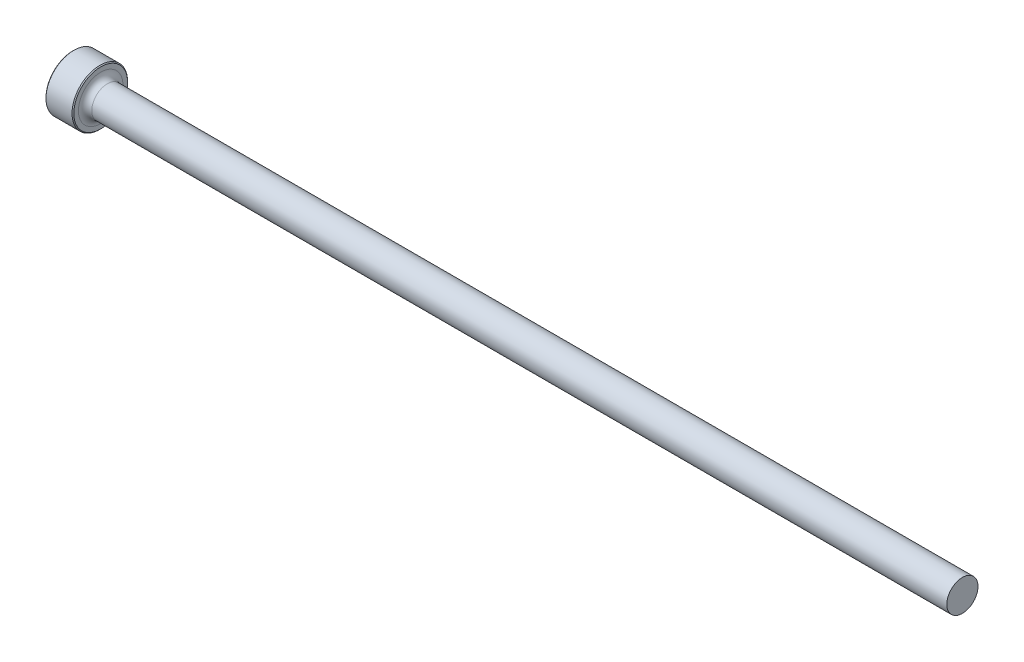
from build123d import *

# Parameters (mm, degrees)
CHAMFER1_SIZE = 0.1016


with BuildPart() as part:
    # Sketch1 → Revolve1 (revolve)
    with BuildSketch(Plane.XY):
        with BuildLine():
            Line((0, 0), (0, 3.175))
            Line((0, 3.175), (3.175, 3.175))
            Line((3.175, 3.175), (3.175, 2.5441275))
            ThreePointArc((3.175, 2.5441275), (3.398184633, 2.005312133), (3.937, 1.7821275))
            Line((3.937, 1.7821275), (101.6, 1.7821275))
            Line((101.6, 1.7821275), (101.6, 0))
            Line((101.6, 0), (0, 0))
        make_face()
    revolve(axis=Axis((101.6, 0, 0), (-1, 0, 0)))

    # Chamfer1
    chamfer1_edges = [part.edges().sort_by_distance(p)[0] for p in [
        (0, -3.175, 0),
        (3.175, -3.175, 0),
    ]]
    chamfer(chamfer1_edges, length=CHAMFER1_SIZE)


solid = part.part
